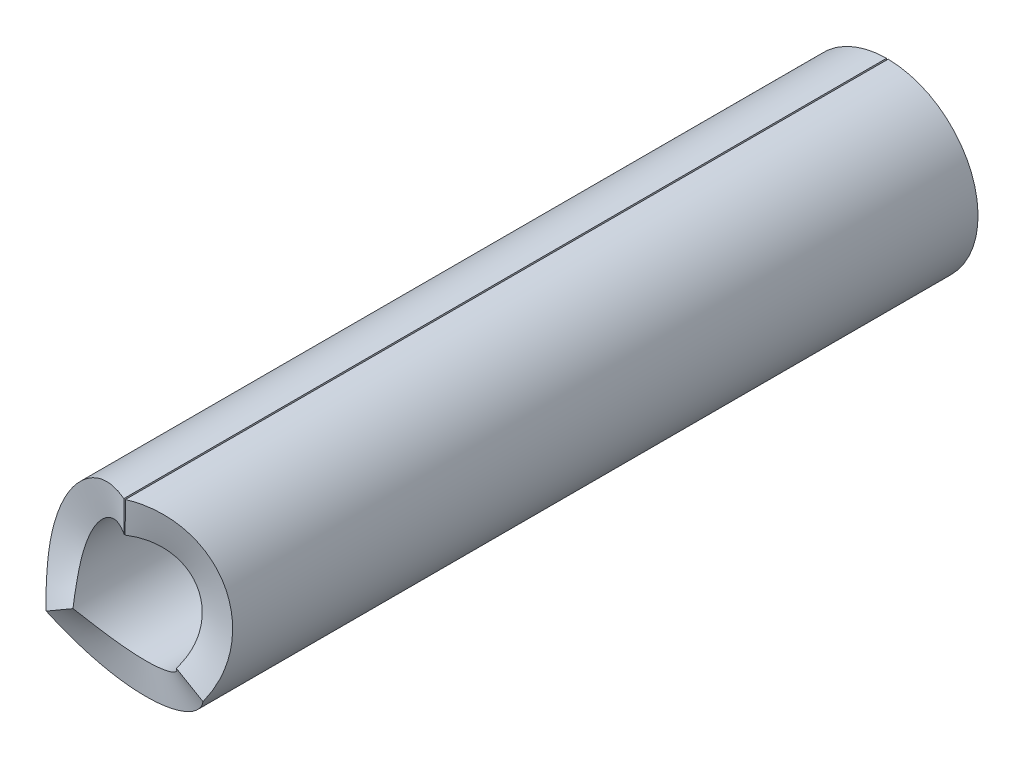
ISO-10303-21;
HEADER;
FILE_DESCRIPTION(('STEP AP214'),'2;1');
FILE_NAME('part.step','',(''),(''),'','','');
FILE_SCHEMA(('AUTOMOTIVE_DESIGN { 1 0 10303 214 1 1 1 1 }'));
ENDSEC;
DATA;
#1=APPLICATION_CONTEXT('core data for automotive mechanical design processes');
#2=APPLICATION_PROTOCOL_DEFINITION('international standard','automotive_design',2000,#1);
#3=PRODUCT_CONTEXT('',#1,'mechanical');
#4=PRODUCT('Part','Part','',(#3));
#5=PRODUCT_RELATED_PRODUCT_CATEGORY('part','',(#4));
#6=PRODUCT_DEFINITION_FORMATION('','',#4);
#7=PRODUCT_DEFINITION_CONTEXT('part definition',#1,'design');
#8=PRODUCT_DEFINITION('design','',#6,#7);
#9=PRODUCT_DEFINITION_SHAPE('','',#8);
#10=(LENGTH_UNIT() NAMED_UNIT(*) SI_UNIT(.MILLI.,.METRE.));
#11=(NAMED_UNIT(*) PLANE_ANGLE_UNIT() SI_UNIT($,.RADIAN.));
#12=(NAMED_UNIT(*) SI_UNIT($,.STERADIAN.) SOLID_ANGLE_UNIT());
#13=UNCERTAINTY_MEASURE_WITH_UNIT(LENGTH_MEASURE(1.E-05),#10,'distance_accuracy_value','');
#14=(GEOMETRIC_REPRESENTATION_CONTEXT(3) GLOBAL_UNCERTAINTY_ASSIGNED_CONTEXT((#13)) GLOBAL_UNIT_ASSIGNED_CONTEXT((#10,
#11,#12)) REPRESENTATION_CONTEXT('',''));
#15=CARTESIAN_POINT('',(0.,0.,0.));
#16=DIRECTION('',(0.,0.,1.));
#17=DIRECTION('',(1.,0.,0.));
#18=AXIS2_PLACEMENT_3D('',#15,#16,#17);
#19=CARTESIAN_POINT('',(-14.6976441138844,-8.54278979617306,143.));
#20=CARTESIAN_POINT('',(-13.9537508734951,-9.82263845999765,142.344469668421));
#21=CARTESIAN_POINT('',(-13.0419133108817,-11.0045037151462,141.770918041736));
#22=CARTESIAN_POINT('',(-10.9439339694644,-13.0927809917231,140.787652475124));
#23=CARTESIAN_POINT('',(-9.75797795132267,-13.9989935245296,140.377958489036));
#24=CARTESIAN_POINT('',(-7.19231054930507,-15.4745152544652,139.722448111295));
#25=CARTESIAN_POINT('',(-5.81279805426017,-16.0437115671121,139.476631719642));
#26=CARTESIAN_POINT('',(-2.95359566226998,-16.806712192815,139.148876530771));
#27=CARTESIAN_POINT('',(-1.47412689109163,-17.0004588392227,139.066937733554));
#28=CARTESIAN_POINT('',(1.48469086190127,-16.9995395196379,139.066937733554));
#29=CARTESIAN_POINT('',(2.96381149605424,-16.8048749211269,139.148876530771));
#30=CARTESIAN_POINT('',(5.82171846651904,-16.0404362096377,139.476631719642));
#31=CARTESIAN_POINT('',(7.20028470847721,-15.4707223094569,139.722448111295));
#32=CARTESIAN_POINT('',(9.76373830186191,-13.9948834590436,140.377958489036));
#33=CARTESIAN_POINT('',(10.948428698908,-13.0888733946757,140.787652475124));
#34=CARTESIAN_POINT('',(13.0439689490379,-11.0018894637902,141.770918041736));
#35=CARTESIAN_POINT('',(13.9546369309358,-9.82111402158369,142.344470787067));
#36=CARTESIAN_POINT('',(14.6976441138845,-8.54278979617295,143.));
#37=CARTESIAN_POINT('',(-9.68315376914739,-5.62819092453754,143.));
#38=CARTESIAN_POINT('',(-9.19306202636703,-6.47138081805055,142.344473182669));
#39=CARTESIAN_POINT('',(-8.59231935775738,-7.2500259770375,141.770918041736));
#40=CARTESIAN_POINT('',(-7.21012120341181,-8.62583218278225,140.787652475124));
#41=CARTESIAN_POINT('',(-6.42878547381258,-9.22286632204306,140.377958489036));
#42=CARTESIAN_POINT('',(-4.73846342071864,-10.194974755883,139.722448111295));
#43=CARTESIAN_POINT('',(-3.82960812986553,-10.5699746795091,139.476631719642));
#44=CARTESIAN_POINT('',(-1.94589831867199,-11.0726574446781,139.148876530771));
#45=CARTESIAN_POINT('',(-0.971189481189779,-11.2003022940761,139.066937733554));
#46=CARTESIAN_POINT('',(0.97814927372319,-11.1996966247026,139.066937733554));
#47=CARTESIAN_POINT('',(1.95262875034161,-11.0714470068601,139.148876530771));
#48=CARTESIAN_POINT('',(3.83548510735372,-10.5678167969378,139.476631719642));
#49=CARTESIAN_POINT('',(4.74371698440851,-10.1924758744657,139.722448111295));
#50=CARTESIAN_POINT('',(6.43258052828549,-9.22015851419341,140.377958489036));
#51=CARTESIAN_POINT('',(7.21308243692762,-8.62325776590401,140.787652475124));
#52=CARTESIAN_POINT('',(8.59367366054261,-7.24830364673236,141.770918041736));
#53=CARTESIAN_POINT('',(9.19364563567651,-6.4703767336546,142.344474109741));
#54=CARTESIAN_POINT('',(9.68315376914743,-5.62819092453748,143.));
#55=B_SPLINE_SURFACE_WITH_KNOTS('',1,3,((#19,#20,#21,#22,#23,#24,#25,#26,#27,#28,#29,#30,#31,
#32,#33,#34,#35,#36),(#37,#38,#39,#40,#41,#42,#43,#44,#45,#46,#47,#48,#49,#50,#51,#52,#53,#54)),
.UNSPECIFIED.,.F.,.F.,.F.,(2,2),(4,2,2,2,2,2,2,2,4),(0.,1.),(0.,0.125,0.25,0.375,0.5,0.625,0.75,
0.875,1.),.UNSPECIFIED.);
#56=CARTESIAN_POINT('',(-14.6976441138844,-8.54278979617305,143.));
#57=CARTESIAN_POINT('',(-9.68315376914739,-5.62819092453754,143.));
#58=B_SPLINE_CURVE_WITH_KNOTS('',1,(#56,#57),.UNSPECIFIED.,.F.,.F.,(2,2),(0.,1.),.UNSPECIFIED.);
#59=CARTESIAN_POINT('',(-14.6976438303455,-8.54279028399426,142.999999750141));
#60=VERTEX_POINT('',#59);
#61=CARTESIAN_POINT('',(-9.68315376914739,-5.62819092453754,143.));
#62=VERTEX_POINT('',#61);
#63=EDGE_CURVE('E12',#60,#62,#58,.T.);
#64=CARTESIAN_POINT('',(-14.6976441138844,-8.54278979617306,143.));
#65=CARTESIAN_POINT('',(-13.9537508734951,-9.82263845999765,142.344469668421));
#66=CARTESIAN_POINT('',(-13.0419133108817,-11.0045037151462,141.770918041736));
#67=CARTESIAN_POINT('',(-10.9439339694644,-13.0927809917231,140.787652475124));
#68=CARTESIAN_POINT('',(-9.75797795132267,-13.9989935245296,140.377958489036));
#69=CARTESIAN_POINT('',(-7.19231054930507,-15.4745152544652,139.722448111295));
#70=CARTESIAN_POINT('',(-5.81279805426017,-16.0437115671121,139.476631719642));
#71=CARTESIAN_POINT('',(-2.95359566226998,-16.806712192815,139.148876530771));
#72=CARTESIAN_POINT('',(-1.47412689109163,-17.0004588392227,139.066937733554));
#73=CARTESIAN_POINT('',(1.48469086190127,-16.9995395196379,139.066937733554));
#74=CARTESIAN_POINT('',(2.96381149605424,-16.8048749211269,139.148876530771));
#75=CARTESIAN_POINT('',(5.82171846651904,-16.0404362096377,139.476631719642));
#76=CARTESIAN_POINT('',(7.20028470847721,-15.4707223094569,139.722448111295));
#77=CARTESIAN_POINT('',(9.76373830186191,-13.9948834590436,140.377958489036));
#78=CARTESIAN_POINT('',(10.948428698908,-13.0888733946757,140.787652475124));
#79=CARTESIAN_POINT('',(13.0439689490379,-11.0018894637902,141.770918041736));
#80=CARTESIAN_POINT('',(13.9546369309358,-9.82111402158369,142.344470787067));
#81=CARTESIAN_POINT('',(14.6976441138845,-8.54278979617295,143.));
#82=B_SPLINE_CURVE_WITH_KNOTS('',3,(#64,#65,#66,#67,#68,#69,#70,#71,#72,#73,#74,#75,#76,#77,#78,
#79,#80,#81),.UNSPECIFIED.,.F.,.F.,(4,2,2,2,2,2,2,2,4),(0.,0.125,0.25,0.375,0.5,0.625,0.75,
0.875,1.),.UNSPECIFIED.);
#83=CARTESIAN_POINT('',(14.6976438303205,-8.54279028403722,142.999999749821));
#84=VERTEX_POINT('',#83);
#85=EDGE_CURVE('E104',#60,#84,#82,.T.);
#86=CARTESIAN_POINT('',(14.6976441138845,-8.54278979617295,143.));
#87=CARTESIAN_POINT('',(9.68315376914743,-5.62819092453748,143.));
#88=B_SPLINE_CURVE_WITH_KNOTS('',1,(#86,#87),.UNSPECIFIED.,.F.,.F.,(2,2),(0.,1.),.UNSPECIFIED.);
#89=CARTESIAN_POINT('',(9.68315376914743,-5.62819092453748,143.));
#90=VERTEX_POINT('',#89);
#91=EDGE_CURVE('E69',#84,#90,#88,.T.);
#92=CARTESIAN_POINT('',(9.68315376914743,-5.62819092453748,143.));
#93=CARTESIAN_POINT('',(9.19364563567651,-6.4703767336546,142.344474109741));
#94=CARTESIAN_POINT('',(8.59367366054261,-7.24830364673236,141.770918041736));
#95=CARTESIAN_POINT('',(7.21308243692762,-8.62325776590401,140.787652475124));
#96=CARTESIAN_POINT('',(6.43258052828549,-9.22015851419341,140.377958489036));
#97=CARTESIAN_POINT('',(4.74371698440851,-10.1924758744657,139.722448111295));
#98=CARTESIAN_POINT('',(3.83548510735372,-10.5678167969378,139.476631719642));
#99=CARTESIAN_POINT('',(1.95262875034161,-11.0714470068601,139.148876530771));
#100=CARTESIAN_POINT('',(0.97814927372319,-11.1996966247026,139.066937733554));
#101=CARTESIAN_POINT('',(-0.971189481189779,-11.2003022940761,139.066937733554));
#102=CARTESIAN_POINT('',(-1.94589831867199,-11.0726574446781,139.148876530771));
#103=CARTESIAN_POINT('',(-3.82960812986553,-10.5699746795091,139.476631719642));
#104=CARTESIAN_POINT('',(-4.73846342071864,-10.194974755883,139.722448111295));
#105=CARTESIAN_POINT('',(-6.42878547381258,-9.22286632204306,140.377958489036));
#106=CARTESIAN_POINT('',(-7.21012120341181,-8.62583218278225,140.787652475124));
#107=CARTESIAN_POINT('',(-8.59231935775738,-7.2500259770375,141.770918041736));
#108=CARTESIAN_POINT('',(-9.19306202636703,-6.47138081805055,142.344473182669));
#109=CARTESIAN_POINT('',(-9.68315376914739,-5.62819092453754,143.));
#110=B_SPLINE_CURVE_WITH_KNOTS('',3,(#92,#93,#94,#95,#96,#97,#98,#99,#100,#101,#102,#103,#104,
#105,#106,#107,#108,#109),.UNSPECIFIED.,.F.,.F.,(4,2,2,2,2,2,2,2,4),(0.,0.125,0.25,0.375,0.5,
0.625,0.75,0.875,1.),.UNSPECIFIED.);
#111=EDGE_CURVE('E108',#62,#90,#110,.F.);
#112=ORIENTED_EDGE('',*,*,#63,.F.);
#113=ORIENTED_EDGE('',*,*,#85,.T.);
#114=ORIENTED_EDGE('',*,*,#91,.T.);
#115=ORIENTED_EDGE('',*,*,#111,.F.);
#116=EDGE_LOOP('',(#112,#113,#114,#115));
#117=FACE_BOUND('',#116,.T.);
#118=ADVANCED_FACE('F55',(#117),#55,.F.);
#119=CARTESIAN_POINT('',(14.6976441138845,-8.542789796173,143.));
#120=CARTESIAN_POINT('',(15.4415373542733,-7.26294113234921,142.344469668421));
#121=CARTESIAN_POINT('',(16.0171663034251,-5.88565955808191,141.770918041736));
#122=CARTESIAN_POINT('',(16.7933097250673,-3.02908456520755,140.787652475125));
#123=CARTESIAN_POINT('',(16.9937428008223,-1.55005129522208,140.377958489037));
#124=CARTESIAN_POINT('',(17.0059671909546,1.40962168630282,139.722448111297));
#125=CARTESIAN_POINT('',(16.8177588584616,2.89003270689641,139.476631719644));
#126=CARTESIAN_POINT('',(16.0655735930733,5.75209937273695,139.148876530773));
#127=CARTESIAN_POINT('',(15.5016559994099,7.13353433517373,139.066937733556));
#128=CARTESIAN_POINT('',(14.0363807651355,9.70405409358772,139.066937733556));
#129=CARTESIAN_POINT('',(13.1351373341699,10.8929411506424,139.148876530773));
#130=CARTESIAN_POINT('',(11.0563712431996,12.9978711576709,139.476631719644));
#131=CARTESIAN_POINT('',(9.87900983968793,13.9137526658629,139.722448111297));
#132=CARTESIAN_POINT('',(7.32783486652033,15.4107165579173,140.377958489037));
#133=CARTESIAN_POINT('',(5.95421860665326,15.991684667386,140.787652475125));
#134=CARTESIAN_POINT('',(3.1036029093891,16.7795812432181,141.770918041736));
#135=CARTESIAN_POINT('',(1.62686590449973,16.9864498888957,142.344470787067));
#136=CARTESIAN_POINT('',(0.148351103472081,16.9993526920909,143.));
#137=CARTESIAN_POINT('',(9.68315376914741,-5.62819092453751,143.));
#138=CARTESIAN_POINT('',(10.1732455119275,-4.78500103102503,142.344473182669));
#139=CARTESIAN_POINT('',(10.5524860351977,-3.87761100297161,141.770918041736));
#140=CARTESIAN_POINT('',(11.0638275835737,-1.99563218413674,140.787652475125));
#141=CARTESIAN_POINT('',(11.1958776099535,-1.02121026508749,140.377958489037));
#142=CARTESIAN_POINT('',(11.2039313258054,0.928691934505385,139.722448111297));
#143=CARTESIAN_POINT('',(11.0799352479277,1.90402154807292,139.476631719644));
#144=CARTESIAN_POINT('',(10.584377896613,3.78961841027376,139.148876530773));
#145=CARTESIAN_POINT('',(10.2128557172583,4.69974026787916,139.066937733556));
#146=CARTESIAN_POINT('',(9.24749791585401,6.39325916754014,139.066937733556));
#147=CARTESIAN_POINT('',(8.65373753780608,7.1765259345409,139.148876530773));
#148=CARTESIAN_POINT('',(7.28419752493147,8.56330335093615,139.476631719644));
#149=CARTESIAN_POINT('',(6.50852412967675,9.16670763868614,139.722448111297));
#150=CARTESIAN_POINT('',(4.82775002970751,10.1529426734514,140.377958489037));
#151=CARTESIAN_POINT('',(3.9227793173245,10.5356981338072,140.787652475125));
#152=CARTESIAN_POINT('',(2.04472662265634,11.0547829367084,141.770918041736));
#153=CARTESIAN_POINT('',(1.07181259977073,11.1910729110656,142.344474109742));
#154=CARTESIAN_POINT('',(0.0977371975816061,11.1995735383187,143.));
#155=B_SPLINE_SURFACE_WITH_KNOTS('',1,3,((#119,#120,#121,#122,#123,#124,#125,#126,#127,#128,
#129,#130,#131,#132,#133,#134,#135,#136),(#137,#138,#139,#140,#141,#142,#143,#144,#145,#146,
#147,#148,#149,#150,#151,#152,#153,#154)),.UNSPECIFIED.,.F.,.F.,.F.,(2,2),(4,2,2,2,2,2,2,2,4),
(0.,1.),(0.,0.125,0.25,0.375,0.5,0.625,0.75,0.875,1.),.UNSPECIFIED.);
#156=CARTESIAN_POINT('',(14.6976441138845,-8.542789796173,143.));
#157=CARTESIAN_POINT('',(15.4415373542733,-7.26294113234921,142.344469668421));
#158=CARTESIAN_POINT('',(16.0171663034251,-5.88565955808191,141.770918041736));
#159=CARTESIAN_POINT('',(16.7933097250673,-3.02908456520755,140.787652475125));
#160=CARTESIAN_POINT('',(16.9937428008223,-1.55005129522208,140.377958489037));
#161=CARTESIAN_POINT('',(17.0059671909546,1.40962168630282,139.722448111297));
#162=CARTESIAN_POINT('',(16.8177588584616,2.89003270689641,139.476631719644));
#163=CARTESIAN_POINT('',(16.0655735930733,5.75209937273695,139.148876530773));
#164=CARTESIAN_POINT('',(15.5016559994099,7.13353433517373,139.066937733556));
#165=CARTESIAN_POINT('',(14.0363807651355,9.70405409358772,139.066937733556));
#166=CARTESIAN_POINT('',(13.1351373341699,10.8929411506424,139.148876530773));
#167=CARTESIAN_POINT('',(11.0563712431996,12.9978711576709,139.476631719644));
#168=CARTESIAN_POINT('',(9.87900983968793,13.9137526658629,139.722448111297));
#169=CARTESIAN_POINT('',(7.32783486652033,15.4107165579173,140.377958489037));
#170=CARTESIAN_POINT('',(5.95421860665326,15.991684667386,140.787652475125));
#171=CARTESIAN_POINT('',(3.1036029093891,16.7795812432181,141.770918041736));
#172=CARTESIAN_POINT('',(1.62686590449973,16.9864498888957,142.344470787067));
#173=CARTESIAN_POINT('',(0.148351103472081,16.9993526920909,143.));
#174=B_SPLINE_CURVE_WITH_KNOTS('',3,(#156,#157,#158,#159,#160,#161,#162,#163,#164,#165,#166,
#167,#168,#169,#170,#171,#172,#173),.UNSPECIFIED.,.F.,.F.,(4,2,2,2,2,2,2,2,4),(0.,0.125,0.25,
0.375,0.5,0.625,0.75,0.875,1.),.UNSPECIFIED.);
#175=CARTESIAN_POINT('',(0.148351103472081,16.9993526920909,143.));
#176=VERTEX_POINT('',#175);
#177=EDGE_CURVE('E127',#84,#176,#174,.T.);
#178=CARTESIAN_POINT('',(0.148351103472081,16.9993526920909,143.));
#179=CARTESIAN_POINT('',(0.0977371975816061,11.1995735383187,143.));
#180=B_SPLINE_CURVE_WITH_KNOTS('',1,(#178,#179),.UNSPECIFIED.,.F.,.F.,(2,2),(0.,1.),.UNSPECIFIED.);
#181=CARTESIAN_POINT('',(0.0977371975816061,11.1995735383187,143.));
#182=VERTEX_POINT('',#181);
#183=EDGE_CURVE('E151',#176,#182,#180,.T.);
#184=CARTESIAN_POINT('',(0.0977371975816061,11.1995735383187,143.));
#185=CARTESIAN_POINT('',(1.07181259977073,11.1910729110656,142.344474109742));
#186=CARTESIAN_POINT('',(2.04472662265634,11.0547829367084,141.770918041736));
#187=CARTESIAN_POINT('',(3.9227793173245,10.5356981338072,140.787652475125));
#188=CARTESIAN_POINT('',(4.82775002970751,10.1529426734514,140.377958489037));
#189=CARTESIAN_POINT('',(6.50852412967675,9.16670763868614,139.722448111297));
#190=CARTESIAN_POINT('',(7.28419752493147,8.56330335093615,139.476631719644));
#191=CARTESIAN_POINT('',(8.65373753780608,7.1765259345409,139.148876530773));
#192=CARTESIAN_POINT('',(9.24749791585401,6.39325916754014,139.066937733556));
#193=CARTESIAN_POINT('',(10.2128557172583,4.69974026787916,139.066937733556));
#194=CARTESIAN_POINT('',(10.584377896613,3.78961841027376,139.148876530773));
#195=CARTESIAN_POINT('',(11.0799352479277,1.90402154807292,139.476631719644));
#196=CARTESIAN_POINT('',(11.2039313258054,0.928691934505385,139.722448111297));
#197=CARTESIAN_POINT('',(11.1958776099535,-1.02121026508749,140.377958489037));
#198=CARTESIAN_POINT('',(11.0638275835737,-1.99563218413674,140.787652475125));
#199=CARTESIAN_POINT('',(10.5524860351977,-3.87761100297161,141.770918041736));
#200=CARTESIAN_POINT('',(10.1732455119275,-4.78500103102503,142.344473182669));
#201=CARTESIAN_POINT('',(9.68315376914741,-5.62819092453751,143.));
#202=B_SPLINE_CURVE_WITH_KNOTS('',3,(#184,#185,#186,#187,#188,#189,#190,#191,#192,#193,#194,
#195,#196,#197,#198,#199,#200,#201),.UNSPECIFIED.,.F.,.F.,(4,2,2,2,2,2,2,2,4),(0.,0.125,0.25,
0.375,0.5,0.625,0.75,0.875,1.),.UNSPECIFIED.);
#203=EDGE_CURVE('E243',#90,#182,#202,.F.);
#204=ORIENTED_EDGE('',*,*,#91,.F.);
#205=ORIENTED_EDGE('',*,*,#177,.T.);
#206=ORIENTED_EDGE('',*,*,#183,.T.);
#207=ORIENTED_EDGE('',*,*,#203,.F.);
#208=EDGE_LOOP('',(#204,#205,#206,#207));
#209=FACE_BOUND('',#208,.T.);
#210=ADVANCED_FACE('F163',(#209),#155,.F.);
#211=CARTESIAN_POINT('',(0.0977371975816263,11.1995735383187,71.5));
#212=DIRECTION('',(0.999961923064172,-0.00872653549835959,0.));
#213=DIRECTION('',(0.,0.,-1.));
#214=AXIS2_PLACEMENT_3D('',#211,#212,#213);
#215=PLANE('',#214);
#216=ORIENTED_EDGE('',*,*,#183,.F.);
#217=DIRECTION('',(0.,0.,-1.));
#218=VECTOR('',#217,1.);
#219=CARTESIAN_POINT('',(0.148351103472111,16.9993526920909,239.742938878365));
#220=LINE('',#219,#218);
#221=CARTESIAN_POINT('',(0.148351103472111,16.9993526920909,0.));
#222=VERTEX_POINT('',#221);
#223=EDGE_CURVE('E275',#176,#222,#220,.T.);
#224=ORIENTED_EDGE('',*,*,#223,.T.);
#225=DIRECTION('',(-0.00872653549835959,-0.999961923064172,0.));
#226=VECTOR('',#225,1.);
#227=CARTESIAN_POINT('',(0.0977371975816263,11.1995735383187,0.));
#228=LINE('',#227,#226);
#229=CARTESIAN_POINT('',(0.0977371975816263,11.1995735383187,0.));
#230=VERTEX_POINT('',#229);
#231=EDGE_CURVE('E148',#222,#230,#228,.T.);
#232=ORIENTED_EDGE('',*,*,#231,.T.);
#233=DIRECTION('',(0.,0.,-1.));
#234=VECTOR('',#233,1.);
#235=CARTESIAN_POINT('',(0.0977371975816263,11.1995735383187,143.));
#236=LINE('',#235,#234);
#237=EDGE_CURVE('E235',#182,#230,#236,.T.);
#238=ORIENTED_EDGE('',*,*,#237,.F.);
#239=EDGE_LOOP('',(#216,#224,#232,#238));
#240=FACE_BOUND('',#239,.T.);
#241=ADVANCED_FACE('F174',(#240),#215,.F.);
#242=CARTESIAN_POINT('',(0.,0.,0.));
#243=DIRECTION('',(0.,0.,1.));
#244=DIRECTION('',(1.,0.,0.));
#245=AXIS2_PLACEMENT_3D('',#242,#243,#244);
#246=PLANE('',#245);
#247=ORIENTED_EDGE('',*,*,#231,.F.);
#248=CARTESIAN_POINT('',(0.,0.,0.));
#249=DIRECTION('',(0.,0.,-1.));
#250=DIRECTION('',(-1.,0.,0.));
#251=AXIS2_PLACEMENT_3D('',#248,#249,#250);
#252=CIRCLE('',#251,17.);
#253=CARTESIAN_POINT('',(-0.148351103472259,16.9993526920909,0.));
#254=VERTEX_POINT('',#253);
#255=EDGE_CURVE('E272',#222,#254,#252,.T.);
#256=ORIENTED_EDGE('',*,*,#255,.T.);
#257=DIRECTION('',(0.00872653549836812,-0.999961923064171,0.));
#258=VECTOR('',#257,1.);
#259=CARTESIAN_POINT('',(-0.0977371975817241,11.1995735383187,0.));
#260=LINE('',#259,#258);
#261=CARTESIAN_POINT('',(-0.0977371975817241,11.1995735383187,0.));
#262=VERTEX_POINT('',#261);
#263=EDGE_CURVE('E141',#254,#262,#260,.T.);
#264=ORIENTED_EDGE('',*,*,#263,.T.);
#265=CARTESIAN_POINT('',(0.,0.,0.));
#266=DIRECTION('',(0.,0.,-1.));
#267=DIRECTION('',(-1.,0.,0.));
#268=AXIS2_PLACEMENT_3D('',#265,#266,#267);
#269=CIRCLE('',#268,11.2);
#270=EDGE_CURVE('E242',#230,#262,#269,.T.);
#271=ORIENTED_EDGE('',*,*,#270,.F.);
#272=EDGE_LOOP('',(#247,#256,#264,#271));
#273=FACE_BOUND('',#272,.T.);
#274=ADVANCED_FACE('F315',(#273),#246,.F.);
#275=CARTESIAN_POINT('',(-0.09773719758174,11.1995735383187,71.5));
#276=DIRECTION('',(-0.999961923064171,-0.00872653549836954,0.));
#277=DIRECTION('',(0.,0.,1.));
#278=AXIS2_PLACEMENT_3D('',#275,#276,#277);
#279=PLANE('',#278);
#280=ORIENTED_EDGE('',*,*,#263,.F.);
#281=DIRECTION('',(0.,0.,-1.));
#282=VECTOR('',#281,1.);
#283=CARTESIAN_POINT('',(-0.148351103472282,16.9993526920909,239.742938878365));
#284=LINE('',#283,#282);
#285=CARTESIAN_POINT('',(-0.148351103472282,16.9993526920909,143.));
#286=VERTEX_POINT('',#285);
#287=EDGE_CURVE('E132',#254,#286,#284,.F.);
#288=ORIENTED_EDGE('',*,*,#287,.T.);
#289=CARTESIAN_POINT('',(-0.0977371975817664,11.1995735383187,143.));
#290=CARTESIAN_POINT('',(-0.148351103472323,16.9993526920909,143.));
#291=B_SPLINE_CURVE_WITH_KNOTS('',1,(#289,#290),.UNSPECIFIED.,.F.,.F.,(2,2),(0.,1.),.UNSPECIFIED.);
#292=CARTESIAN_POINT('',(-0.0977371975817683,11.1995735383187,143.));
#293=VERTEX_POINT('',#292);
#294=EDGE_CURVE('E77',#286,#293,#291,.F.);
#295=ORIENTED_EDGE('',*,*,#294,.T.);
#296=DIRECTION('',(0.,0.,1.));
#297=VECTOR('',#296,1.);
#298=CARTESIAN_POINT('',(-0.0977371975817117,11.1995735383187,0.));
#299=LINE('',#298,#297);
#300=EDGE_CURVE('E248',#262,#293,#299,.T.);
#301=ORIENTED_EDGE('',*,*,#300,.F.);
#302=EDGE_LOOP('',(#280,#288,#295,#301));
#303=FACE_BOUND('',#302,.T.);
#304=ADVANCED_FACE('F224',(#303),#279,.F.);
#305=CARTESIAN_POINT('',(-0.148351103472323,16.9993526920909,143.));
#306=CARTESIAN_POINT('',(-1.69723729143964,16.9858357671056,142.314087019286));
#307=CARTESIAN_POINT('',(-3.16611021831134,16.7611566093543,141.729631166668));
#308=CARTESIAN_POINT('',(-5.19097982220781,16.2032060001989,141.003531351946));
#309=CARTESIAN_POINT('',(-5.83648709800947,15.980461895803,140.786684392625));
#310=CARTESIAN_POINT('',(-6.75680862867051,15.6030597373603,140.499193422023));
#311=CARTESIAN_POINT('',(-7.05561786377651,15.4700403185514,140.409659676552));
#312=CARTESIAN_POINT('',(-7.49162601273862,15.2611111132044,140.284803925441));
#313=CARTESIAN_POINT('',(-7.63492916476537,15.1899009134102,140.244759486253));
#314=CARTESIAN_POINT('',(-7.84681417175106,15.0809089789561,140.187054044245));
#315=CARTESIAN_POINT('',(-7.91693096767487,15.0442155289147,140.168212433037));
#316=CARTESIAN_POINT('',(-8.0213370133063,14.988652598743,140.14054032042));
#317=CARTESIAN_POINT('',(-8.05601084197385,14.9700444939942,140.131414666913));
#318=CARTESIAN_POINT('',(-8.1078291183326,14.9420043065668,140.117873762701));
#319=CARTESIAN_POINT('',(-8.12506979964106,14.9326362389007,140.113384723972));
#320=CARTESIAN_POINT('',(-8.15948697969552,14.9138578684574,140.10445583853));
#321=CARTESIAN_POINT('',(-8.1727617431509,14.9065939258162,140.101020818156));
#322=CARTESIAN_POINT('',(-9.5407602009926,14.1540525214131,139.748715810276));
#323=CARTESIAN_POINT('',(-10.7961213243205,13.2239577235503,139.488537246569));
#324=CARTESIAN_POINT('',(-13.0207568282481,11.0403435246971,139.141592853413));
#325=CARTESIAN_POINT('',(-13.988092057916,9.78978559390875,139.054827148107));
#326=CARTESIAN_POINT('',(-15.5553193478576,7.03837064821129,139.05470797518));
#327=CARTESIAN_POINT('',(-16.1395912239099,5.56306912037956,139.141605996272));
#328=CARTESIAN_POINT('',(-16.6968164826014,3.2901147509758,139.402389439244));
#329=CARTESIAN_POINT('',(-16.8296353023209,2.52248908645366,139.511056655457));
#330=CARTESIAN_POINT('',(-16.9493563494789,1.36719173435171,139.706666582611));
#331=CARTESIAN_POINT('',(-16.9760284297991,0.98144733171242,139.777304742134));
#332=CARTESIAN_POINT('',(-17.00307260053,0.210481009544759,139.929450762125));
#333=CARTESIAN_POINT('',(-17.0034494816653,-0.17970344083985,140.012088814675));
#334=CARTESIAN_POINT('',(-16.9648010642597,-1.33935628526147,140.273645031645));
#335=CARTESIAN_POINT('',(-16.8870893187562,-2.08582766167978,140.463957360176));
#336=CARTESIAN_POINT('',(-16.7081612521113,-3.15728732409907,140.773338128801));
#337=CARTESIAN_POINT('',(-16.6381252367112,-3.50644045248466,140.880450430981));
#338=CARTESIAN_POINT('',(-16.519396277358,-4.01747814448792,141.047096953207));
#339=CARTESIAN_POINT('',(-16.4775404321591,-4.18571097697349,141.103642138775));
#340=CARTESIAN_POINT('',(-16.411572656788,-4.43482375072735,141.189954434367));
#341=CARTESIAN_POINT('',(-16.3890526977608,-4.51732206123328,141.21897428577));
#342=CARTESIAN_POINT('',(-16.3602636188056,-4.61976484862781,141.255560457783));
#343=CARTESIAN_POINT('',(-16.3572609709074,-4.63036081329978,141.259365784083));
#344=CARTESIAN_POINT('',(-16.3490145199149,-4.65939394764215,141.269820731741));
#345=CARTESIAN_POINT('',(-16.3448473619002,-4.67399164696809,141.27509904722));
#346=CARTESIAN_POINT('',(-16.3322120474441,-4.71802738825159,141.291086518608));
#347=CARTESIAN_POINT('',(-16.3236100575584,-4.74770807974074,141.301948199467));
#348=CARTESIAN_POINT('',(-16.0336730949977,-5.73777870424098,141.667094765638));
#349=CARTESIAN_POINT('',(-15.5725385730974,-7.03755699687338,142.228111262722));
#350=CARTESIAN_POINT('',(-14.6976441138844,-8.54278979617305,143.));
#351=CARTESIAN_POINT('',(-0.0977371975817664,11.1995735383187,143.));
#352=CARTESIAN_POINT('',(-1.11808660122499,11.1906690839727,142.314149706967));
#353=CARTESIAN_POINT('',(-2.08590790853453,11.0426443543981,141.729631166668));
#354=CARTESIAN_POINT('',(-3.41993964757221,10.6750533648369,141.003531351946));
#355=CARTESIAN_POINT('',(-3.84521502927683,10.5283043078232,140.786684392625));
#356=CARTESIAN_POINT('',(-4.45154450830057,10.2796628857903,140.499193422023));
#357=CARTESIAN_POINT('',(-4.64840706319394,10.1920265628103,140.409659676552));
#358=CARTESIAN_POINT('',(-4.93565949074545,10.0543790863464,140.284803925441));
#359=CARTESIAN_POINT('',(-5.03007097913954,10.0074641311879,140.244759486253));
#360=CARTESIAN_POINT('',(-5.16966580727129,9.93565768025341,140.187054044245));
#361=CARTESIAN_POINT('',(-5.21586040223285,9.91148317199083,140.168212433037));
#362=CARTESIAN_POINT('',(-5.28464556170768,9.87487700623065,140.14054032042));
#363=CARTESIAN_POINT('',(-5.30748949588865,9.86261754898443,140.131414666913));
#364=CARTESIAN_POINT('',(-5.34162859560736,9.8441440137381,140.117873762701));
#365=CARTESIAN_POINT('',(-5.35298716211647,9.83797211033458,140.113384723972));
#366=CARTESIAN_POINT('',(-5.37566201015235,9.82560047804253,140.10445583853));
#367=CARTESIAN_POINT('',(-5.38440773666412,9.82081482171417,140.101020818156));
#368=CARTESIAN_POINT('',(-6.28567730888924,9.32502283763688,139.748715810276));
#369=CARTESIAN_POINT('',(-7.11273875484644,8.71225450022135,139.488537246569));
#370=CARTESIAN_POINT('',(-8.57838096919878,7.27363808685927,139.141592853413));
#371=CARTESIAN_POINT('',(-9.2156841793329,6.44974109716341,139.054827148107));
#372=CARTESIAN_POINT('',(-10.2482103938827,4.63704419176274,139.05470797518));
#373=CARTESIAN_POINT('',(-10.6331424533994,3.66508083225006,139.141605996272));
#374=CARTESIAN_POINT('',(-11.000255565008,2.16760501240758,139.402389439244));
#375=CARTESIAN_POINT('',(-11.0877597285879,1.66187516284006,139.511056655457));
#376=CARTESIAN_POINT('',(-11.1666347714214,0.900738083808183,139.706666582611));
#377=CARTESIAN_POINT('',(-11.1842069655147,0.646600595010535,139.777304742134));
#378=CARTESIAN_POINT('',(-11.2020243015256,0.138669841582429,139.929450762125));
#379=CARTESIAN_POINT('',(-11.2022725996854,-0.118392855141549,140.012088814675));
#380=CARTESIAN_POINT('',(-11.176810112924,-0.88239943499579,140.273645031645));
#381=CARTESIAN_POINT('',(-11.1256117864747,-1.37419234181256,140.463957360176));
#382=CARTESIAN_POINT('',(-11.0077297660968,-2.08009517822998,140.773338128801));
#383=CARTESIAN_POINT('',(-10.961588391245,-2.31012547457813,140.880450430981));
#384=CARTESIAN_POINT('',(-10.8833669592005,-2.64680913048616,141.047096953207));
#385=CARTESIAN_POINT('',(-10.8557913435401,-2.75764487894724,141.103642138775));
#386=CARTESIAN_POINT('',(-10.8123302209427,-2.92176623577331,141.189954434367));
#387=CARTESIAN_POINT('',(-10.7974935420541,-2.97611806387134,141.21897428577));
#388=CARTESIAN_POINT('',(-10.7785266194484,-3.04360978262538,141.255560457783));
#389=CARTESIAN_POINT('',(-10.7765484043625,-3.05059065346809,141.259365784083));
#390=CARTESIAN_POINT('',(-10.7711154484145,-3.06971836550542,141.269820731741));
#391=CARTESIAN_POINT('',(-10.7683700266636,-3.07933567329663,141.27509904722));
#392=CARTESIAN_POINT('',(-10.7600455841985,-3.10834745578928,141.291086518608));
#393=CARTESIAN_POINT('',(-10.754378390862,-3.12790179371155,141.301948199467));
#394=CARTESIAN_POINT('',(-10.5633610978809,-3.78018361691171,141.667094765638));
#395=CARTESIAN_POINT('',(-10.2593819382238,-4.63680558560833,142.228342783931));
#396=CARTESIAN_POINT('',(-9.68315376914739,-5.62819092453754,143.));
#397=B_SPLINE_SURFACE_WITH_KNOTS('',1,3,((#305,#306,#307,#308,#309,#310,#311,#312,#313,#314,
#315,#316,#317,#318,#319,#320,#321,#322,#323,#324,#325,#326,#327,#328,#329,#330,#331,#332,#333,
#334,#335,#336,#337,#338,#339,#340,#341,#342,#343,#344,#345,#346,#347,#348,#349,#350),(#351,
#352,#353,#354,#355,#356,#357,#358,#359,#360,#361,#362,#363,#364,#365,#366,#367,#368,#369,#370,
#371,#372,#373,#374,#375,#376,#377,#378,#379,#380,#381,#382,#383,#384,#385,#386,#387,#388,#389,
#390,#391,#392,#393,#394,#395,#396)),.UNSPECIFIED.,.F.,.F.,.F.,(2,2),(4,2,2,2,2,2,2,2,2,2,2,2,2,
2,2,2,2,2,2,2,2,2,4),(0.,1.),(0.,0.125,0.1875,0.21875,0.234375,0.2421875,0.24609375,0.248046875,
0.25,0.375,0.5,0.625,0.6875,0.71875,0.75,0.8125,0.84375,0.859375,0.8671875,0.869140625,
0.87109375,0.875,1.),.UNSPECIFIED.);
#398=CARTESIAN_POINT('',(-0.148351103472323,16.9993526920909,143.));
#399=CARTESIAN_POINT('',(-1.69723729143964,16.9858357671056,142.314087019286));
#400=CARTESIAN_POINT('',(-3.16611021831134,16.7611566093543,141.729631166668));
#401=CARTESIAN_POINT('',(-5.19097982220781,16.2032060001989,141.003531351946));
#402=CARTESIAN_POINT('',(-5.83648709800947,15.980461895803,140.786684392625));
#403=CARTESIAN_POINT('',(-6.75680862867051,15.6030597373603,140.499193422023));
#404=CARTESIAN_POINT('',(-7.05561786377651,15.4700403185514,140.409659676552));
#405=CARTESIAN_POINT('',(-7.49162601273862,15.2611111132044,140.284803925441));
#406=CARTESIAN_POINT('',(-7.63492916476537,15.1899009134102,140.244759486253));
#407=CARTESIAN_POINT('',(-7.84681417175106,15.0809089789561,140.187054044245));
#408=CARTESIAN_POINT('',(-7.91693096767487,15.0442155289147,140.168212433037));
#409=CARTESIAN_POINT('',(-8.0213370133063,14.988652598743,140.14054032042));
#410=CARTESIAN_POINT('',(-8.05601084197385,14.9700444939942,140.131414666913));
#411=CARTESIAN_POINT('',(-8.1078291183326,14.9420043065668,140.117873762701));
#412=CARTESIAN_POINT('',(-8.12506979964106,14.9326362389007,140.113384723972));
#413=CARTESIAN_POINT('',(-8.15948697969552,14.9138578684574,140.10445583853));
#414=CARTESIAN_POINT('',(-8.1727617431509,14.9065939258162,140.101020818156));
#415=CARTESIAN_POINT('',(-9.5407602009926,14.1540525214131,139.748715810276));
#416=CARTESIAN_POINT('',(-10.7961213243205,13.2239577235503,139.488537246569));
#417=CARTESIAN_POINT('',(-13.0207568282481,11.0403435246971,139.141592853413));
#418=CARTESIAN_POINT('',(-13.988092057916,9.78978559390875,139.054827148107));
#419=CARTESIAN_POINT('',(-15.5553193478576,7.03837064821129,139.05470797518));
#420=CARTESIAN_POINT('',(-16.1395912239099,5.56306912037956,139.141605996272));
#421=CARTESIAN_POINT('',(-16.6968164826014,3.2901147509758,139.402389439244));
#422=CARTESIAN_POINT('',(-16.8296353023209,2.52248908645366,139.511056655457));
#423=CARTESIAN_POINT('',(-16.9493563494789,1.36719173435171,139.706666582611));
#424=CARTESIAN_POINT('',(-16.9760284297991,0.98144733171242,139.777304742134));
#425=CARTESIAN_POINT('',(-17.00307260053,0.210481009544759,139.929450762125));
#426=CARTESIAN_POINT('',(-17.0034494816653,-0.17970344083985,140.012088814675));
#427=CARTESIAN_POINT('',(-16.9648010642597,-1.33935628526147,140.273645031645));
#428=CARTESIAN_POINT('',(-16.8870893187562,-2.08582766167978,140.463957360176));
#429=CARTESIAN_POINT('',(-16.7081612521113,-3.15728732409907,140.773338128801));
#430=CARTESIAN_POINT('',(-16.6381252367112,-3.50644045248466,140.880450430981));
#431=CARTESIAN_POINT('',(-16.519396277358,-4.01747814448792,141.047096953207));
#432=CARTESIAN_POINT('',(-16.4775404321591,-4.18571097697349,141.103642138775));
#433=CARTESIAN_POINT('',(-16.411572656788,-4.43482375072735,141.189954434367));
#434=CARTESIAN_POINT('',(-16.3890526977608,-4.51732206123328,141.21897428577));
#435=CARTESIAN_POINT('',(-16.3602636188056,-4.61976484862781,141.255560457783));
#436=CARTESIAN_POINT('',(-16.3572609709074,-4.63036081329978,141.259365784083));
#437=CARTESIAN_POINT('',(-16.3490145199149,-4.65939394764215,141.269820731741));
#438=CARTESIAN_POINT('',(-16.3448473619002,-4.67399164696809,141.27509904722));
#439=CARTESIAN_POINT('',(-16.3322120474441,-4.71802738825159,141.291086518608));
#440=CARTESIAN_POINT('',(-16.3236100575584,-4.74770807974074,141.301948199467));
#441=CARTESIAN_POINT('',(-16.0336730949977,-5.73777870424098,141.667094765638));
#442=CARTESIAN_POINT('',(-15.5725385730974,-7.03755699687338,142.228111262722));
#443=CARTESIAN_POINT('',(-14.6976441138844,-8.54278979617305,143.));
#444=B_SPLINE_CURVE_WITH_KNOTS('',3,(#398,#399,#400,#401,#402,#403,#404,#405,#406,#407,#408,
#409,#410,#411,#412,#413,#414,#415,#416,#417,#418,#419,#420,#421,#422,#423,#424,#425,#426,#427,
#428,#429,#430,#431,#432,#433,#434,#435,#436,#437,#438,#439,#440,#441,#442,#443),.UNSPECIFIED.,
.F.,.F.,(4,2,2,2,2,2,2,2,2,2,2,2,2,2,2,2,2,2,2,2,2,2,4),(0.,0.125,0.1875,0.21875,0.234375,
0.2421875,0.24609375,0.248046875,0.25,0.375,0.5,0.625,0.6875,0.71875,0.75,0.8125,0.84375,
0.859375,0.8671875,0.869140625,0.87109375,0.875,1.),.UNSPECIFIED.);
#445=EDGE_CURVE('E123',#286,#60,#444,.T.);
#446=CARTESIAN_POINT('',(-9.68315376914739,-5.62819092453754,143.));
#447=CARTESIAN_POINT('',(-10.2593819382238,-4.63680558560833,142.228342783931));
#448=CARTESIAN_POINT('',(-10.5633610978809,-3.78018361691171,141.667094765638));
#449=CARTESIAN_POINT('',(-10.754378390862,-3.12790179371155,141.301948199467));
#450=CARTESIAN_POINT('',(-10.7600455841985,-3.10834745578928,141.291086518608));
#451=CARTESIAN_POINT('',(-10.7683700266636,-3.07933567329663,141.27509904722));
#452=CARTESIAN_POINT('',(-10.7711154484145,-3.06971836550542,141.269820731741));
#453=CARTESIAN_POINT('',(-10.7765484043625,-3.05059065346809,141.259365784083));
#454=CARTESIAN_POINT('',(-10.7785266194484,-3.04360978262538,141.255560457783));
#455=CARTESIAN_POINT('',(-10.7974935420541,-2.97611806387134,141.21897428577));
#456=CARTESIAN_POINT('',(-10.8123302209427,-2.92176623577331,141.189954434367));
#457=CARTESIAN_POINT('',(-10.8557913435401,-2.75764487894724,141.103642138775));
#458=CARTESIAN_POINT('',(-10.8833669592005,-2.64680913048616,141.047096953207));
#459=CARTESIAN_POINT('',(-10.961588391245,-2.31012547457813,140.880450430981));
#460=CARTESIAN_POINT('',(-11.0077297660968,-2.08009517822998,140.773338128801));
#461=CARTESIAN_POINT('',(-11.1256117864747,-1.37419234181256,140.463957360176));
#462=CARTESIAN_POINT('',(-11.176810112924,-0.88239943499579,140.273645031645));
#463=CARTESIAN_POINT('',(-11.2022725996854,-0.118392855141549,140.012088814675));
#464=CARTESIAN_POINT('',(-11.2020243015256,0.138669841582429,139.929450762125));
#465=CARTESIAN_POINT('',(-11.1842069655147,0.646600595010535,139.777304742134));
#466=CARTESIAN_POINT('',(-11.1666347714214,0.900738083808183,139.706666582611));
#467=CARTESIAN_POINT('',(-11.0877597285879,1.66187516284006,139.511056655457));
#468=CARTESIAN_POINT('',(-11.000255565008,2.16760501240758,139.402389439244));
#469=CARTESIAN_POINT('',(-10.6331424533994,3.66508083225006,139.141605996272));
#470=CARTESIAN_POINT('',(-10.2482103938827,4.63704419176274,139.05470797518));
#471=CARTESIAN_POINT('',(-9.2156841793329,6.44974109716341,139.054827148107));
#472=CARTESIAN_POINT('',(-8.57838096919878,7.27363808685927,139.141592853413));
#473=CARTESIAN_POINT('',(-7.11273875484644,8.71225450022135,139.488537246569));
#474=CARTESIAN_POINT('',(-6.28567730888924,9.32502283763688,139.748715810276));
#475=CARTESIAN_POINT('',(-5.38440773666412,9.82081482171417,140.101020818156));
#476=CARTESIAN_POINT('',(-5.37566201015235,9.82560047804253,140.10445583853));
#477=CARTESIAN_POINT('',(-5.35298716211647,9.83797211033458,140.113384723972));
#478=CARTESIAN_POINT('',(-5.34162859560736,9.8441440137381,140.117873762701));
#479=CARTESIAN_POINT('',(-5.30748949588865,9.86261754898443,140.131414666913));
#480=CARTESIAN_POINT('',(-5.28464556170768,9.87487700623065,140.14054032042));
#481=CARTESIAN_POINT('',(-5.21586040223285,9.91148317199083,140.168212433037));
#482=CARTESIAN_POINT('',(-5.16966580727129,9.93565768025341,140.187054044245));
#483=CARTESIAN_POINT('',(-5.03007097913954,10.0074641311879,140.244759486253));
#484=CARTESIAN_POINT('',(-4.93565949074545,10.0543790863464,140.284803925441));
#485=CARTESIAN_POINT('',(-4.64840706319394,10.1920265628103,140.409659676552));
#486=CARTESIAN_POINT('',(-4.45154450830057,10.2796628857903,140.499193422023));
#487=CARTESIAN_POINT('',(-3.84521502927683,10.5283043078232,140.786684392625));
#488=CARTESIAN_POINT('',(-3.41993964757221,10.6750533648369,141.003531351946));
#489=CARTESIAN_POINT('',(-2.08590790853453,11.0426443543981,141.729631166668));
#490=CARTESIAN_POINT('',(-1.11808660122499,11.1906690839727,142.314149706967));
#491=CARTESIAN_POINT('',(-0.0977371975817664,11.1995735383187,143.));
#492=B_SPLINE_CURVE_WITH_KNOTS('',3,(#446,#447,#448,#449,#450,#451,#452,#453,#454,#455,#456,
#457,#458,#459,#460,#461,#462,#463,#464,#465,#466,#467,#468,#469,#470,#471,#472,#473,#474,#475,
#476,#477,#478,#479,#480,#481,#482,#483,#484,#485,#486,#487,#488,#489,#490,#491),.UNSPECIFIED.,
.F.,.F.,(4,2,2,2,2,2,2,2,2,2,2,2,2,2,2,2,2,2,2,2,2,2,4),(0.,0.125,0.12890625,0.130859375,
0.1328125,0.140625,0.15625,0.1875,0.25,0.28125,0.3125,0.375,0.5,0.625,0.75,0.751953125,
0.75390625,0.7578125,0.765625,0.78125,0.8125,0.875,1.),.UNSPECIFIED.);
#493=EDGE_CURVE('E255',#293,#62,#492,.F.);
#494=ORIENTED_EDGE('',*,*,#445,.T.);
#495=ORIENTED_EDGE('',*,*,#63,.T.);
#496=ORIENTED_EDGE('',*,*,#493,.F.);
#497=ORIENTED_EDGE('',*,*,#294,.F.);
#498=EDGE_LOOP('',(#494,#495,#496,#497));
#499=FACE_BOUND('',#498,.T.);
#500=ADVANCED_FACE('F57',(#499),#397,.F.);
#501=CARTESIAN_POINT('',(0.,0.,239.742938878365));
#502=DIRECTION('',(0.,0.,-1.));
#503=DIRECTION('',(-1.,0.,0.));
#504=AXIS2_PLACEMENT_3D('',#501,#502,#503);
#505=CYLINDRICAL_SURFACE('',#504,11.2);
#506=ORIENTED_EDGE('',*,*,#300,.T.);
#507=ORIENTED_EDGE('',*,*,#493,.T.);
#508=ORIENTED_EDGE('',*,*,#111,.T.);
#509=ORIENTED_EDGE('',*,*,#203,.T.);
#510=ORIENTED_EDGE('',*,*,#237,.T.);
#511=ORIENTED_EDGE('',*,*,#270,.T.);
#512=EDGE_LOOP('',(#506,#507,#508,#509,#510,#511));
#513=FACE_BOUND('',#512,.T.);
#514=ADVANCED_FACE('F215',(#513),#505,.F.);
#515=CARTESIAN_POINT('',(0.,0.,239.742938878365));
#516=DIRECTION('',(0.,0.,-1.));
#517=DIRECTION('',(-1.,0.,0.));
#518=AXIS2_PLACEMENT_3D('',#515,#516,#517);
#519=CYLINDRICAL_SURFACE('',#518,17.);
#520=ORIENTED_EDGE('',*,*,#287,.F.);
#521=ORIENTED_EDGE('',*,*,#255,.F.);
#522=ORIENTED_EDGE('',*,*,#223,.F.);
#523=ORIENTED_EDGE('',*,*,#177,.F.);
#524=ORIENTED_EDGE('',*,*,#85,.F.);
#525=ORIENTED_EDGE('',*,*,#445,.F.);
#526=EDGE_LOOP('',(#520,#521,#522,#523,#524,#525));
#527=FACE_BOUND('',#526,.T.);
#528=ADVANCED_FACE('F122',(#527),#519,.T.);
#529=CLOSED_SHELL('',(#118,#210,#241,#274,#304,#500,#514,#528));
#530=MANIFOLD_SOLID_BREP('B2',#529);
#531=ADVANCED_BREP_SHAPE_REPRESENTATION('',(#18,#530),#14);
#532=SHAPE_DEFINITION_REPRESENTATION(#9,#531);
ENDSEC;
END-ISO-10303-21;
